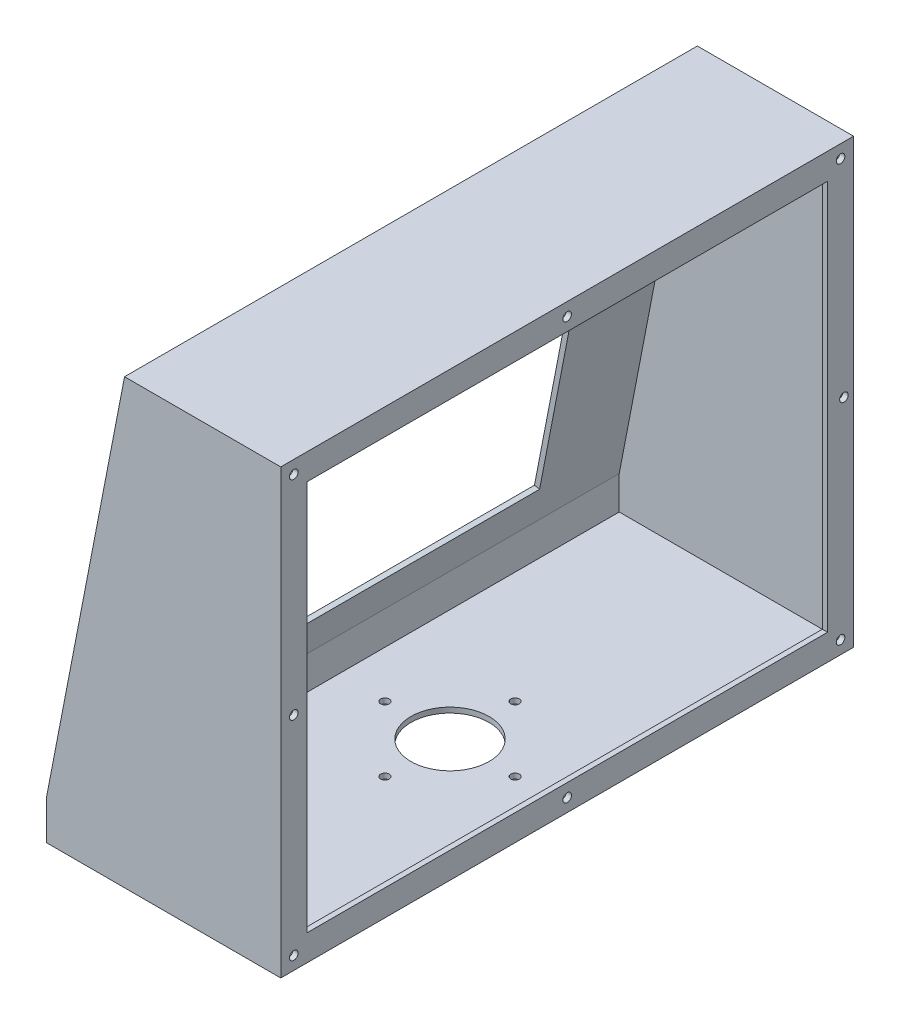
from build123d import *

# Parameters (mm, degrees)
EXTRUDE_1_DEPTH        = 220
SKETCH_3_W             = 200
SKETCH_3_H             = 150
CUT_EXTRUDE_3_DEPTH    = 60
SHELL_2_T              = -2
CUT_EXTRUDE_6_REACH    = 285.794
SKETCH_4_W             = 157
SKETCH_4_H             = 125
CUT_EXTRUDE_7_REACH    = 285.794
SKETCH_5_R             = 8
SKETCH_6_R             = 15
CUT_EXTRUDE_8_DEPTH    = 2
HOLE_WIZARD_M4_1_D     = 3.3
HOLE_WIZARD_M4_1_DEPTH = 10.1
HOLE_WIZARD_M4_1_TIP   = 0.991420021
HOLE_WIZARD_M4_2_D     = 3.3
HOLE_WIZARD_M4_2_DEPTH = 10.1
HOLE_WIZARD_M4_2_TIP   = 0.991420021


with BuildPart() as part:
    # Sketch 1 → Extrude 1 (new body)
    with BuildSketch(Plane.XY):
        Polygon((0, 0), (-30, -155), (-30, -170), (60, -170), (60, 0), align=None)
    extrude(amount=EXTRUDE_1_DEPTH)

    # Sketch 3 → Cut-Extrude 3 (cut)
    with BuildSketch(Plane(origin=(60, 0, 0), x_dir=(0, 0, -1), z_dir=(1, 0, 0))):
        with Locations((-110, -85)):
            Rectangle(SKETCH_3_W, SKETCH_3_H)
    extrude(amount=-CUT_EXTRUDE_3_DEPTH, mode=Mode.SUBTRACT)

    # Shell 2
    shell_2_openings = [part.faces().sort_by_distance(p)[0] for p in [
        (30, -10, 110),
        (30, -85, 10),
        (30, -160, 110),
        (30, -85, 210),
        (0, -85, 110),
    ]]
    offset(amount=SHELL_2_T, openings=shell_2_openings, kind=Kind.INTERSECTION)

    # Sketch 4 → Cut-Extrude 6 (cut, up to next)
    with BuildSketch(Plane(origin=(1.963559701, -0.380043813, 0), x_dir=(0, 0, -1), z_dir=(0.9817798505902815, -0.19002190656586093, 0)), mode=Mode.PRIVATE) as cut_extrude_6_sk1:
        with Locations((-113.5, -82.5)):
            Rectangle(SKETCH_4_W, SKETCH_4_H)
    cut_extrude_6_tool1 = extrude(cut_extrude_6_sk1.sketch, amount=-CUT_EXTRUDE_6_REACH, mode=Mode.PRIVATE) & part.part
    add(cut_extrude_6_tool1.solids().sort_by_distance((-13.713248, -81.376881, 113.5))[0], mode=Mode.SUBTRACT)

    # Sketch 5 → Cut-Extrude 7 (cut, up to next)
    with BuildSketch(Plane(origin=(1.963559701, -0.380043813, 0), x_dir=(0, 0, -1), z_dir=(0.9817798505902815, -0.19002190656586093, 0)), mode=Mode.PRIVATE) as cut_extrude_7_sk1:
        with Locations(Location((-15, -30, 0), (0, 0, 90))):
            Circle(SKETCH_5_R)
    cut_extrude_7_tool1 = extrude(cut_extrude_7_sk1.sketch, amount=-CUT_EXTRUDE_7_REACH, mode=Mode.PRIVATE) & part.part
    add(cut_extrude_7_tool1.solids().sort_by_distance((-3.737097, -29.833439, 15))[0], mode=Mode.SUBTRACT)

    # Sketch 6 → Cut-Extrude 8 (cut)
    with BuildSketch(Plane.XZ.offset(170)):
        with Locations(Location((15, 110, 0), (0, 0, 270))):
            Circle(SKETCH_6_R)
    extrude(amount=-CUT_EXTRUDE_8_DEPTH, mode=Mode.SUBTRACT)

    # Hole Wizard M4 _1
    with Locations(Plane(origin=(0, -168, 0), x_dir=(-1, 0, 0), z_dir=(0, 1, 0))):
        with Locations((10, 110), (-15, 135), (-15, 85), (-40, 110)):
            Hole(HOLE_WIZARD_M4_1_D / 2, depth=HOLE_WIZARD_M4_1_DEPTH)
            with Locations((0, 0, -(HOLE_WIZARD_M4_1_DEPTH + HOLE_WIZARD_M4_1_TIP / 2))):  # 118° drill point
                Cone(0, HOLE_WIZARD_M4_1_D / 2, HOLE_WIZARD_M4_1_TIP, mode=Mode.SUBTRACT)

    # Hole Wizard M4 _2
    with Locations(Plane(origin=(60, 0, 0), x_dir=(0, 0, -1), z_dir=(1, 0, 0))):
        with Locations((-215, -5), (-215, -85), (-215, -165), (-110, -165), (-5, -165), (-3.693916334, -85), (-5, -5), (-110, -5)):
            Hole(HOLE_WIZARD_M4_2_D / 2, depth=HOLE_WIZARD_M4_2_DEPTH)
            with Locations((0, 0, -(HOLE_WIZARD_M4_2_DEPTH + HOLE_WIZARD_M4_2_TIP / 2))):  # 118° drill point
                Cone(0, HOLE_WIZARD_M4_2_D / 2, HOLE_WIZARD_M4_2_TIP, mode=Mode.SUBTRACT)


solid = part.part
